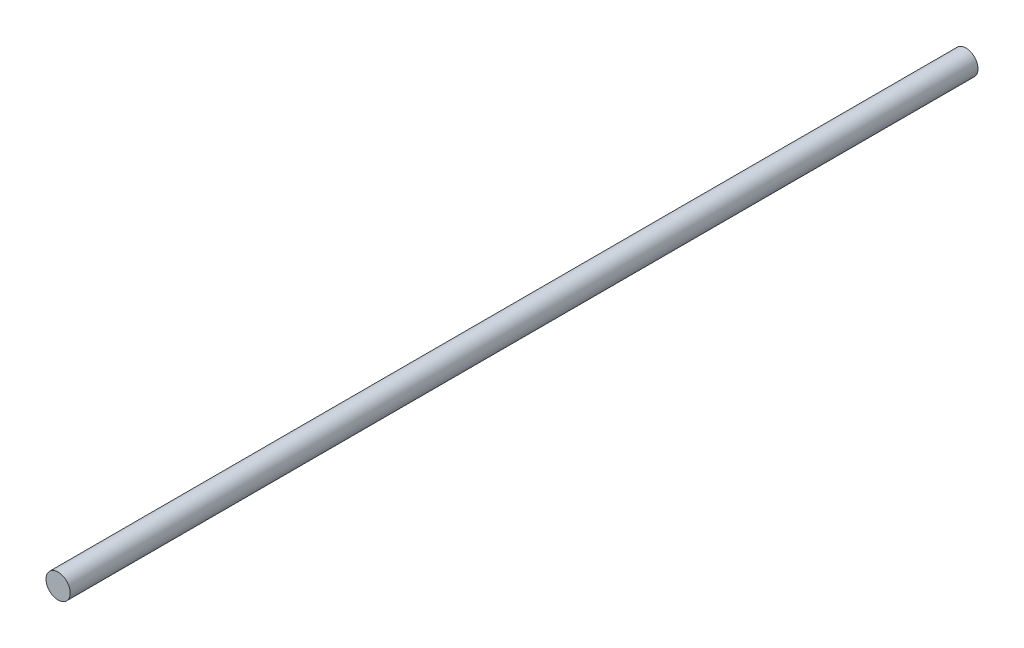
from build123d import *

# Parameters (mm, degrees)
SKETCH1_R           = 30
BOSS_EXTRUDE1_DEPTH = 2250


with BuildPart() as part:
    # Sketch1 → Boss-Extrude1 (new body)
    with BuildSketch(Plane.XY):
        Circle(SKETCH1_R)
    extrude(amount=-BOSS_EXTRUDE1_DEPTH)


solid = part.part
